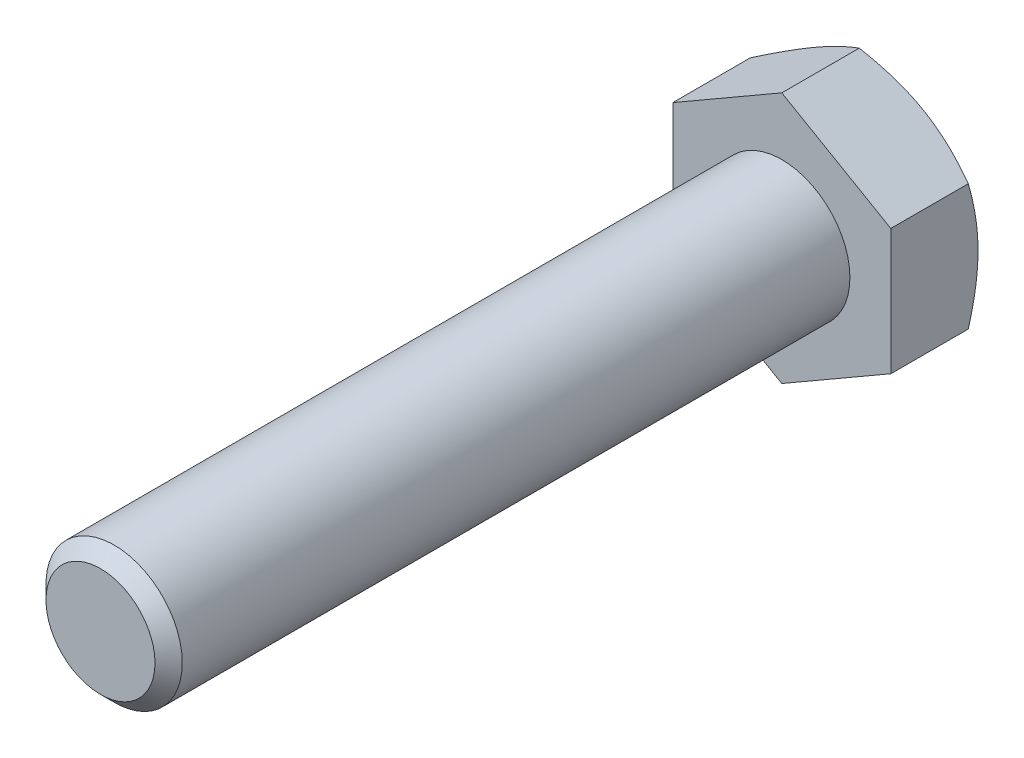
from build123d import *

# Parameters (mm, degrees)
ESQUISSE1_W        = 5
ESQUISSE1_H        = 50
CHANFREIN1_SIZE    = 1
BOSS_EXTRU_1_DEPTH = 6.4


with BuildPart() as part:
    # Esquisse1 → Base-R_volution (revolve)
    with BuildSketch(Plane(origin=(0, 0, 0), x_dir=(1, 0, 0), z_dir=(0, 1, 0))):
        with Locations((2.5, -25)):
            Rectangle(ESQUISSE1_W, ESQUISSE1_H)
    revolve(axis=Axis((0, 0, 0), (0, 0, 1)))

    # Chanfrein1
    chanfrein1_edges = [part.edges().sort_by_distance(p)[0] for p in [
        (-5, 0, 50),
    ]]
    chamfer(chanfrein1_edges, length=CHANFREIN1_SIZE)

    # Esquisse6 → Boss.-Extru.1 (add)
    with BuildSketch(Plane.XY):
        Polygon((8, -4.618802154), (8, 4.618802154), (0, 9.237604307), (-8, 4.618802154), (-8, -4.618802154), (0, -9.237604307), align=None)
    extrude(amount=-BOSS_EXTRU_1_DEPTH)

    # Esquisse7 → Enl_vement de mati_re-R_volution1 (revolve, cut)
    with BuildSketch(Plane(origin=(0, 0, 0), x_dir=(1, 0, 0), z_dir=(0, 1, 0))):
        Polygon((-8, 6.4), (-19.085125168, 6.4), (-19.085125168, 0), align=None)
    revolve(axis=Axis((0, 0, -6.239446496), (0, 0, 1)), mode=Mode.SUBTRACT)


solid = part.part
